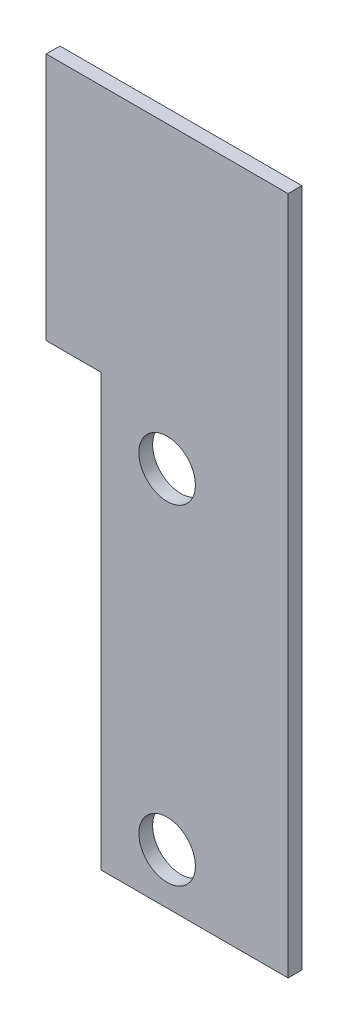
from build123d import *

# Parameters (mm, degrees)
SKETCH1_W                      = 68.690434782
SKETCH1_H                      = 75.206086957
EXTRUDE1_DEPTH                 = 0.79375
CUT_EXTRUDE1_DEPTH             = 83.681192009
F_30_0_128500_DIAMETER_HOLE1_D = 3.2639
CUT_EXTRUDE2_DEPTH             = 83.681192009


with BuildPart() as part:
    # Sketch1 → Extrude1 (new body)
    with BuildSketch(Plane.XY):
        with Locations((0, -37.603043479)):
            Rectangle(SKETCH1_W, SKETCH1_H)
    extrude(amount=EXTRUDE1_DEPTH)

    # Sketch2 → Cut-Extrude1 (cut, through all)
    with BuildSketch(Plane.XY.offset(0.79375)):
        Polygon((0, -39.230080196), (-3.81, -39.230080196), (-3.81, -14.338080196), (-6.985, -14.338080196), (-6.985, 0), (-34.345217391, 0), (-34.345217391, -75.206086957), (0, -75.206086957), align=None)
    extrude(amount=-CUT_EXTRUDE1_DEPTH, mode=Mode.SUBTRACT)

    # 30 _0.128500_ Diameter Hole1 (through all)
    with Locations(Plane.XY.offset(0.79375)):
        with Locations((0, -17.259080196), (0, -36.309080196)):
            Hole(F_30_0_128500_DIAMETER_HOLE1_D / 2)

    # Sketch5 → Cut-Extrude2 (cut, through all)
    with BuildSketch(Plane.XY.offset(0.79375)):
        Polygon((0, -39.230080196), (6.985, -39.230080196), (6.985, 0), (34.345217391, 0), (34.345217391, -75.206086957), (0, -75.206086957), align=None)
    extrude(amount=-CUT_EXTRUDE2_DEPTH, mode=Mode.SUBTRACT)


solid = part.part
